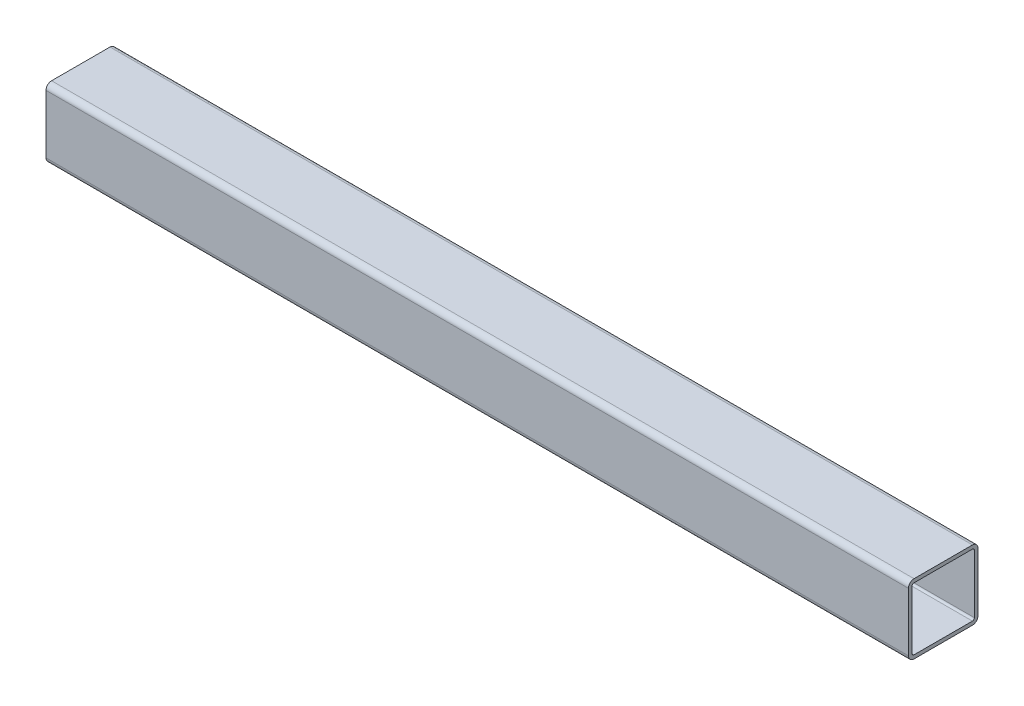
from build123d import *

# Parameters (mm, degrees)
BOSS_EXTRUDE1_DEPTH = 393.7


with BuildPart() as part:
    # Sketch1 → Boss-Extrude1 (new body)
    with BuildSketch(Plane(origin=(0, 0, 0), x_dir=(0, 0, -1), z_dir=(1, 0, 0))):
        with BuildLine():
            Line((0, 2.54), (0, 29.21))
            ThreePointArc((0, 29.21), (-0.743948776, 31.006051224), (-2.54, 31.75))
            Line((-2.54, 31.75), (-29.21, 31.75))
            ThreePointArc((-29.21, 31.75), (-31.006051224, 31.006051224), (-31.75, 29.21))
            Line((-31.75, 29.21), (-31.75, 2.54))
            ThreePointArc((-31.75, 2.54), (-31.006051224, 0.743948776), (-29.21, 0))
            Line((-29.21, 0), (-2.54, 0))
            ThreePointArc((-2.54, 0), (-0.743948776, 0.743948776), (0, 2.54))
        make_face()
        with BuildLine():
            Line((-1.651, 2.54), (-1.651, 29.21))
            ThreePointArc((-1.651, 29.21), (-1.911382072, 29.838617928), (-2.54, 30.099))
            Line((-2.54, 30.099), (-29.21, 30.099))
            ThreePointArc((-29.21, 30.099), (-29.838617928, 29.838617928), (-30.099, 29.21))
            Line((-30.099, 29.21), (-30.099, 2.54))
            ThreePointArc((-30.099, 2.54), (-29.838617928, 1.911382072), (-29.21, 1.651))
            Line((-29.21, 1.651), (-2.54, 1.651))
            ThreePointArc((-2.54, 1.651), (-1.911382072, 1.911382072), (-1.651, 2.54))
        make_face(mode=Mode.SUBTRACT)
    extrude(amount=BOSS_EXTRUDE1_DEPTH)


solid = part.part
